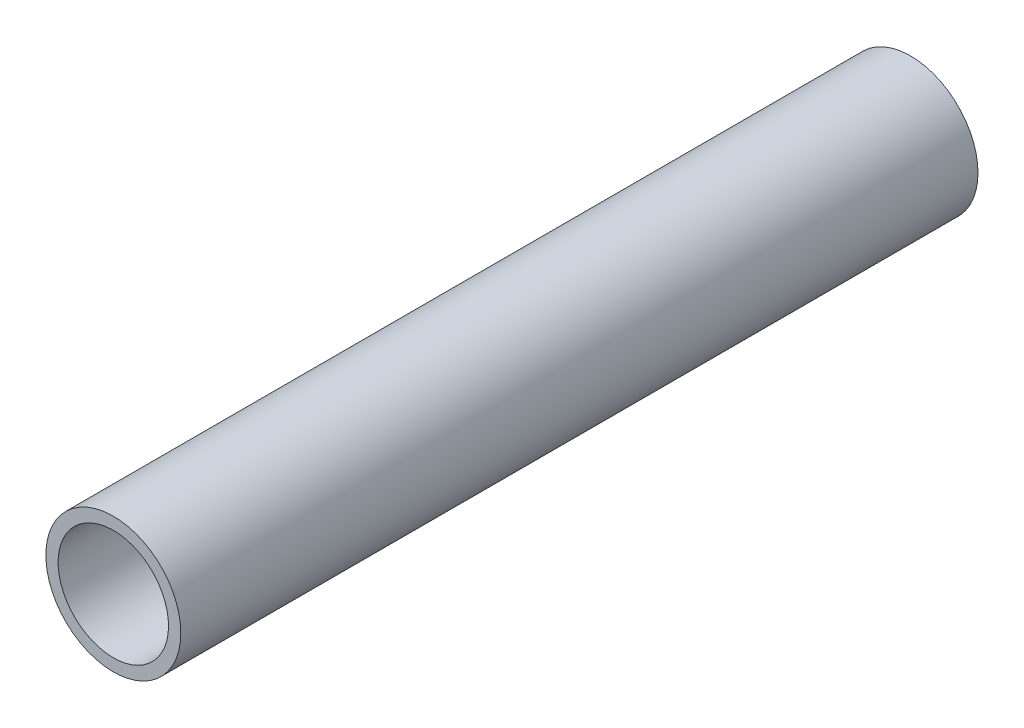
from build123d import *

# Parameters (mm, degrees)
CROQUIS1_R              = 11
CROQUIS1_R_2            = 9
SALIENTE_EXTRUIR1_DEPTH = 130


with BuildPart() as part:
    # Croquis1 → Saliente-Extruir1 (new body)
    with BuildSketch(Plane.XY):
        Circle(CROQUIS1_R)
        Circle(CROQUIS1_R_2, mode=Mode.SUBTRACT)
    extrude(amount=SALIENTE_EXTRUIR1_DEPTH)


solid = part.part
